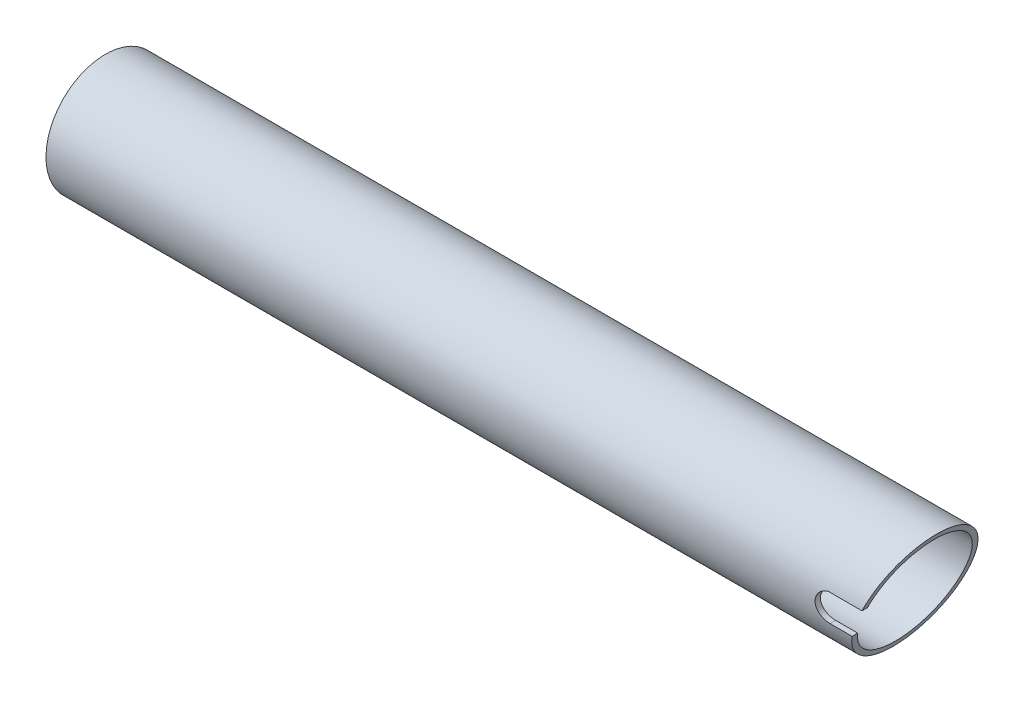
from build123d import *

# Parameters (mm, degrees)
ESQUISSE1_R                  = 11
ESQUISSE1_R_2                = 10
EXTRU_MINCE1_DEPTH           = 160
ENL_V_MAT_EXTRU_1_DEPTH      = 161.754471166
ENL_V_MAT_EXTRU_1_DEPTH_BACK = 161.754471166
ENL_V_MAT_EXTRU_2_DEPTH      = 155.787374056


with BuildPart() as part:
    # Esquisse1 → Extru.-Mince1 (new body)
    with BuildSketch(Plane(origin=(0, 0, 0), x_dir=(0, 0, -1), z_dir=(1, 0, 0))):
        Circle(ESQUISSE1_R)
        Circle(ESQUISSE1_R_2, mode=Mode.SUBTRACT)
    extrude(amount=EXTRU_MINCE1_DEPTH)

    # Esquisse2 → Enl_v. mat.-Extru.1 (cut, two sides: drawn at the far end of the back side and taken through both)
    with BuildSketch(Plane.XY.offset(-ENL_V_MAT_EXTRU_1_DEPTH_BACK)):
        Polygon((263.838056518, 312.767489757), (154.003672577, 11), (145.996327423, -11), (36.161943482, -312.767489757), (639.696922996, -532.436257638), (867.373036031, 93.098721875), align=None)
    extrude(amount=ENL_V_MAT_EXTRU_1_DEPTH + ENL_V_MAT_EXTRU_1_DEPTH_BACK, mode=Mode.SUBTRACT)

    # Esquisse3 → Enl_v. mat.-Extru.2 (cut, through all)
    with BuildSketch(Plane.XY):
        with BuildLine():
            Line((150.909925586, 2.5), (145, 2.5))
            ThreePointArc((145, 2.5), (142.5, 0), (145, -2.5))
            Line((145, -2.5), (149.090074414, -2.5))
            Line((149.090074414, -2.5), (150.909925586, 2.5))
        make_face()
    extrude(amount=ENL_V_MAT_EXTRU_2_DEPTH, mode=Mode.SUBTRACT)


solid = part.part
